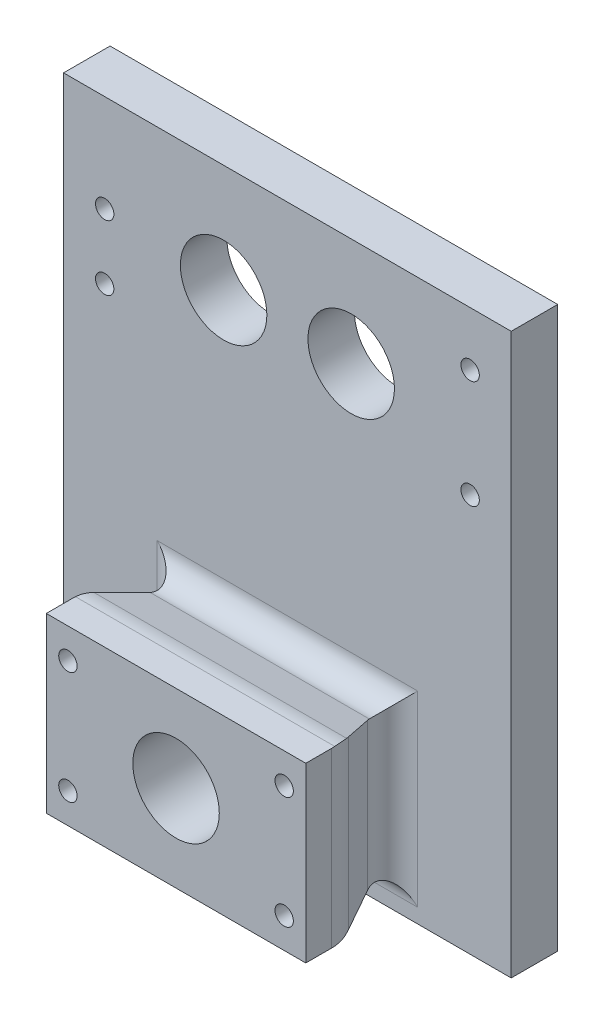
ISO-10303-21;
HEADER;
FILE_DESCRIPTION(('STEP AP214'),'2;1');
FILE_NAME('part.step','',(''),(''),'','','');
FILE_SCHEMA(('AUTOMOTIVE_DESIGN { 1 0 10303 214 1 1 1 1 }'));
ENDSEC;
DATA;
#1=APPLICATION_CONTEXT('core data for automotive mechanical design processes');
#2=APPLICATION_PROTOCOL_DEFINITION('international standard','automotive_design',2000,#1);
#3=PRODUCT_CONTEXT('',#1,'mechanical');
#4=PRODUCT('Part','Part','',(#3));
#5=PRODUCT_RELATED_PRODUCT_CATEGORY('part','',(#4));
#6=PRODUCT_DEFINITION_FORMATION('','',#4);
#7=PRODUCT_DEFINITION_CONTEXT('part definition',#1,'design');
#8=PRODUCT_DEFINITION('design','',#6,#7);
#9=PRODUCT_DEFINITION_SHAPE('','',#8);
#10=(LENGTH_UNIT() NAMED_UNIT(*) SI_UNIT(.MILLI.,.METRE.));
#11=(NAMED_UNIT(*) PLANE_ANGLE_UNIT() SI_UNIT($,.RADIAN.));
#12=(NAMED_UNIT(*) SI_UNIT($,.STERADIAN.) SOLID_ANGLE_UNIT());
#13=UNCERTAINTY_MEASURE_WITH_UNIT(LENGTH_MEASURE(1.E-05),#10,'distance_accuracy_value','');
#14=(GEOMETRIC_REPRESENTATION_CONTEXT(3) GLOBAL_UNCERTAINTY_ASSIGNED_CONTEXT((#13)) GLOBAL_UNIT_ASSIGNED_CONTEXT((#10,
#11,#12)) REPRESENTATION_CONTEXT('',''));
#15=CARTESIAN_POINT('',(0.,0.,0.));
#16=DIRECTION('',(0.,0.,1.));
#17=DIRECTION('',(1.,0.,0.));
#18=AXIS2_PLACEMENT_3D('',#15,#16,#17);
#19=CARTESIAN_POINT('',(-60.,40.,17.));
#20=DIRECTION('',(1.,0.,0.));
#21=DIRECTION('',(0.,1.,0.));
#22=AXIS2_PLACEMENT_3D('',#19,#20,#21);
#23=PLANE('',#22);
#24=DIRECTION('',(0.,0.,-1.));
#25=VECTOR('',#24,1.);
#26=CARTESIAN_POINT('',(-60.,40.,17.));
#27=LINE('',#26,#25);
#28=CARTESIAN_POINT('',(-60.,40.,17.));
#29=VERTEX_POINT('',#28);
#30=CARTESIAN_POINT('',(-60.,40.,5.19968101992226));
#31=VERTEX_POINT('',#30);
#32=EDGE_CURVE('E412',#29,#31,#27,.T.);
#33=ORIENTED_EDGE('',*,*,#32,.T.);
#34=DIRECTION('',(0.,-1.,0.));
#35=VECTOR('',#34,1.);
#36=CARTESIAN_POINT('',(-60.,-40.,5.19968101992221));
#37=LINE('',#36,#35);
#38=CARTESIAN_POINT('',(-60.,-40.,5.19968101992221));
#39=VERTEX_POINT('',#38);
#40=EDGE_CURVE('E399',#31,#39,#37,.T.);
#41=ORIENTED_EDGE('',*,*,#40,.T.);
#42=DIRECTION('',(0.,0.,-1.));
#43=VECTOR('',#42,1.);
#44=CARTESIAN_POINT('',(-60.,-40.,17.));
#45=LINE('',#44,#43);
#46=CARTESIAN_POINT('',(-60.,-40.,17.));
#47=VERTEX_POINT('',#46);
#48=EDGE_CURVE('E416',#47,#39,#45,.T.);
#49=ORIENTED_EDGE('',*,*,#48,.F.);
#50=DIRECTION('',(0.,-1.,0.));
#51=VECTOR('',#50,1.);
#52=CARTESIAN_POINT('',(-60.,40.,17.));
#53=LINE('',#52,#51);
#54=EDGE_CURVE('E277',#29,#47,#53,.T.);
#55=ORIENTED_EDGE('',*,*,#54,.F.);
#56=EDGE_LOOP('',(#33,#41,#49,#55));
#57=FACE_BOUND('',#56,.T.);
#58=ADVANCED_FACE('F46',(#57),#23,.F.);
#59=CARTESIAN_POINT('',(-60.,-40.,17.));
#60=DIRECTION('',(0.,1.,0.));
#61=DIRECTION('',(0.,0.,1.));
#62=AXIS2_PLACEMENT_3D('',#59,#60,#61);
#63=PLANE('',#62);
#64=ORIENTED_EDGE('',*,*,#48,.T.);
#65=CARTESIAN_POINT('',(-35.,-40.,5.19968101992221));
#66=DIRECTION('',(0.,1.,0.));
#67=DIRECTION('',(0.,0.,1.));
#68=AXIS2_PLACEMENT_3D('',#65,#66,#67);
#69=CIRCLE('',#68,25.);
#70=CARTESIAN_POINT('',(-59.9455199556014,-40.,3.55012527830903));
#71=VERTEX_POINT('',#70);
#72=EDGE_CURVE('E429',#39,#71,#69,.F.);
#73=ORIENTED_EDGE('',*,*,#72,.T.);
#74=DIRECTION('',(1.,0.,0.));
#75=VECTOR('',#74,1.);
#76=CARTESIAN_POINT('',(60.,-40.,3.55012527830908));
#77=LINE('',#76,#75);
#78=CARTESIAN_POINT('',(59.9455199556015,-40.,3.55012527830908));
#79=VERTEX_POINT('',#78);
#80=EDGE_CURVE('E426',#71,#79,#77,.T.);
#81=ORIENTED_EDGE('',*,*,#80,.T.);
#82=CARTESIAN_POINT('',(35.,-40.,5.19968101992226));
#83=DIRECTION('',(0.,1.,0.));
#84=DIRECTION('',(0.,0.,1.));
#85=AXIS2_PLACEMENT_3D('',#82,#83,#84);
#86=CIRCLE('',#85,25.);
#87=CARTESIAN_POINT('',(60.,-40.,5.19968101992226));
#88=VERTEX_POINT('',#87);
#89=EDGE_CURVE('E420',#79,#88,#86,.F.);
#90=ORIENTED_EDGE('',*,*,#89,.T.);
#91=DIRECTION('',(0.,0.,-1.));
#92=VECTOR('',#91,1.);
#93=CARTESIAN_POINT('',(60.,-40.,17.));
#94=LINE('',#93,#92);
#95=CARTESIAN_POINT('',(60.,-40.,17.));
#96=VERTEX_POINT('',#95);
#97=EDGE_CURVE('E413',#96,#88,#94,.T.);
#98=ORIENTED_EDGE('',*,*,#97,.F.);
#99=DIRECTION('',(1.,0.,0.));
#100=VECTOR('',#99,1.);
#101=CARTESIAN_POINT('',(-60.,-40.,17.));
#102=LINE('',#101,#100);
#103=EDGE_CURVE('E406',#47,#96,#102,.T.);
#104=ORIENTED_EDGE('',*,*,#103,.F.);
#105=EDGE_LOOP('',(#64,#73,#81,#90,#98,#104));
#106=FACE_BOUND('',#105,.T.);
#107=ADVANCED_FACE('F447',(#106),#63,.F.);
#108=CARTESIAN_POINT('',(60.,40.,17.));
#109=DIRECTION('',(-1.,0.,0.));
#110=DIRECTION('',(0.,-1.,0.));
#111=AXIS2_PLACEMENT_3D('',#108,#109,#110);
#112=PLANE('',#111);
#113=ORIENTED_EDGE('',*,*,#97,.T.);
#114=DIRECTION('',(0.,1.,0.));
#115=VECTOR('',#114,1.);
#116=CARTESIAN_POINT('',(60.,40.,5.19968101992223));
#117=LINE('',#116,#115);
#118=CARTESIAN_POINT('',(60.,40.,5.19968101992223));
#119=VERTEX_POINT('',#118);
#120=EDGE_CURVE('E293',#88,#119,#117,.T.);
#121=ORIENTED_EDGE('',*,*,#120,.T.);
#122=DIRECTION('',(0.,0.,-1.));
#123=VECTOR('',#122,1.);
#124=CARTESIAN_POINT('',(60.,40.,17.));
#125=LINE('',#124,#123);
#126=CARTESIAN_POINT('',(60.,40.,17.));
#127=VERTEX_POINT('',#126);
#128=EDGE_CURVE('E417',#127,#119,#125,.T.);
#129=ORIENTED_EDGE('',*,*,#128,.F.);
#130=DIRECTION('',(0.,1.,0.));
#131=VECTOR('',#130,1.);
#132=CARTESIAN_POINT('',(60.,40.,17.));
#133=LINE('',#132,#131);
#134=EDGE_CURVE('E408',#96,#127,#133,.T.);
#135=ORIENTED_EDGE('',*,*,#134,.F.);
#136=EDGE_LOOP('',(#113,#121,#129,#135));
#137=FACE_BOUND('',#136,.T.);
#138=ADVANCED_FACE('F458',(#137),#112,.F.);
#139=CARTESIAN_POINT('',(-60.,40.,17.));
#140=DIRECTION('',(0.,-1.,0.));
#141=DIRECTION('',(0.,0.,-1.));
#142=AXIS2_PLACEMENT_3D('',#139,#140,#141);
#143=PLANE('',#142);
#144=DIRECTION('',(-1.,0.,0.));
#145=VECTOR('',#144,1.);
#146=CARTESIAN_POINT('',(-60.,40.,3.55012527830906));
#147=LINE('',#146,#145);
#148=CARTESIAN_POINT('',(59.9455199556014,40.,3.55012527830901));
#149=VERTEX_POINT('',#148);
#150=CARTESIAN_POINT('',(-59.9455199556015,40.,3.55012527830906));
#151=VERTEX_POINT('',#150);
#152=EDGE_CURVE('E289',#149,#151,#147,.T.);
#153=ORIENTED_EDGE('',*,*,#152,.T.);
#154=CARTESIAN_POINT('',(-35.,40.,5.19968101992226));
#155=DIRECTION('',(0.,-1.,0.));
#156=DIRECTION('',(0.,0.,-1.));
#157=AXIS2_PLACEMENT_3D('',#154,#155,#156);
#158=CIRCLE('',#157,25.);
#159=EDGE_CURVE('E291',#151,#31,#158,.F.);
#160=ORIENTED_EDGE('',*,*,#159,.T.);
#161=ORIENTED_EDGE('',*,*,#32,.F.);
#162=DIRECTION('',(-1.,0.,0.));
#163=VECTOR('',#162,1.);
#164=CARTESIAN_POINT('',(-60.,40.,17.));
#165=LINE('',#164,#163);
#166=EDGE_CURVE('E410',#127,#29,#165,.T.);
#167=ORIENTED_EDGE('',*,*,#166,.F.);
#168=ORIENTED_EDGE('',*,*,#128,.T.);
#169=CARTESIAN_POINT('',(35.,40.,5.19968101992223));
#170=DIRECTION('',(0.,-1.,0.));
#171=DIRECTION('',(0.,0.,-1.));
#172=AXIS2_PLACEMENT_3D('',#169,#170,#171);
#173=CIRCLE('',#172,25.);
#174=EDGE_CURVE('E287',#119,#149,#173,.F.);
#175=ORIENTED_EDGE('',*,*,#174,.T.);
#176=EDGE_LOOP('',(#153,#160,#161,#167,#168,#175));
#177=FACE_BOUND('',#176,.T.);
#178=ADVANCED_FACE('F466',(#177),#143,.F.);
#179=CARTESIAN_POINT('',(0.,0.,17.));
#180=DIRECTION('',(0.,0.,1.));
#181=DIRECTION('',(1.,0.,0.));
#182=AXIS2_PLACEMENT_3D('',#179,#180,#181);
#183=PLANE('',#182);
#184=CARTESIAN_POINT('',(-50.,26.,17.));
#185=DIRECTION('',(0.,0.,1.));
#186=DIRECTION('',(1.,0.,0.));
#187=AXIS2_PLACEMENT_3D('',#184,#185,#186);
#188=CIRCLE('',#187,4.24999999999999);
#189=CARTESIAN_POINT('',(-45.75,26.,17.));
#190=VERTEX_POINT('',#189);
#191=EDGE_CURVE('E203',#190,#190,#188,.T.);
#192=ORIENTED_EDGE('',*,*,#191,.F.);
#193=EDGE_LOOP('',(#192));
#194=FACE_BOUND('',#193,.T.);
#195=CARTESIAN_POINT('',(50.,26.,17.));
#196=DIRECTION('',(0.,0.,1.));
#197=DIRECTION('',(1.,0.,0.));
#198=AXIS2_PLACEMENT_3D('',#195,#196,#197);
#199=CIRCLE('',#198,4.24999999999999);
#200=CARTESIAN_POINT('',(54.25,26.,17.));
#201=VERTEX_POINT('',#200);
#202=EDGE_CURVE('E202',#201,#201,#199,.T.);
#203=ORIENTED_EDGE('',*,*,#202,.F.);
#204=EDGE_LOOP('',(#203));
#205=FACE_BOUND('',#204,.T.);
#206=CARTESIAN_POINT('',(50.,-26.,17.));
#207=DIRECTION('',(0.,0.,1.));
#208=DIRECTION('',(1.,0.,0.));
#209=AXIS2_PLACEMENT_3D('',#206,#207,#208);
#210=CIRCLE('',#209,4.24999999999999);
#211=CARTESIAN_POINT('',(54.25,-26.,17.));
#212=VERTEX_POINT('',#211);
#213=EDGE_CURVE('E215',#212,#212,#210,.T.);
#214=ORIENTED_EDGE('',*,*,#213,.F.);
#215=EDGE_LOOP('',(#214));
#216=FACE_BOUND('',#215,.T.);
#217=CARTESIAN_POINT('',(-50.,-26.,17.));
#218=DIRECTION('',(0.,0.,1.));
#219=DIRECTION('',(1.,0.,0.));
#220=AXIS2_PLACEMENT_3D('',#217,#218,#219);
#221=CIRCLE('',#220,4.24999999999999);
#222=CARTESIAN_POINT('',(-45.75,-26.,17.));
#223=VERTEX_POINT('',#222);
#224=EDGE_CURVE('E221',#223,#223,#221,.T.);
#225=ORIENTED_EDGE('',*,*,#224,.F.);
#226=EDGE_LOOP('',(#225));
#227=FACE_BOUND('',#226,.T.);
#228=CARTESIAN_POINT('',(0.,0.,17.));
#229=DIRECTION('',(0.,0.,1.));
#230=DIRECTION('',(1.,0.,0.));
#231=AXIS2_PLACEMENT_3D('',#228,#229,#230);
#232=CIRCLE('',#231,20.);
#233=CARTESIAN_POINT('',(20.,0.,17.));
#234=VERTEX_POINT('',#233);
#235=EDGE_CURVE('E232',#234,#234,#232,.T.);
#236=ORIENTED_EDGE('',*,*,#235,.F.);
#237=EDGE_LOOP('',(#236));
#238=FACE_BOUND('',#237,.T.);
#239=ORIENTED_EDGE('',*,*,#54,.T.);
#240=ORIENTED_EDGE('',*,*,#103,.T.);
#241=ORIENTED_EDGE('',*,*,#134,.T.);
#242=ORIENTED_EDGE('',*,*,#166,.T.);
#243=EDGE_LOOP('',(#239,#240,#241,#242));
#244=FACE_BOUND('',#243,.T.);
#245=ADVANCED_FACE('F472',(#194,#205,#216,#227,#238,#244),#183,.T.);
#246=CARTESIAN_POINT('',(50.4610492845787,0.,-21.939586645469));
#247=DIRECTION('',(0.917070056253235,0.,-0.39872611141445));
#248=DIRECTION('',(-0.39872611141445,0.,-0.917070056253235));
#249=AXIS2_PLACEMENT_3D('',#246,#247,#248);
#250=PLANE('',#249);
#251=DIRECTION('',(-0.385344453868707,0.256896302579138,-0.886292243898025));
#252=VECTOR('',#251,1.);
#253=CARTESIAN_POINT('',(60.,-40.,0.));
#254=LINE('',#253,#252);
#255=CARTESIAN_POINT('',(57.9267514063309,-38.6178342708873,-4.76847176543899));
#256=VERTEX_POINT('',#255);
#257=CARTESIAN_POINT('',(51.081417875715,-34.05427858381,-20.5127388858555));
#258=VERTEX_POINT('',#257);
#259=EDGE_CURVE('E278',#256,#258,#254,.T.);
#260=ORIENTED_EDGE('',*,*,#259,.T.);
#261=DIRECTION('',(0.,1.,0.));
#262=VECTOR('',#261,1.);
#263=CARTESIAN_POINT('',(51.081417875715,30.,-20.5127388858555));
#264=LINE('',#263,#262);
#265=CARTESIAN_POINT('',(51.081417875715,34.05427858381,-20.5127388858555));
#266=VERTEX_POINT('',#265);
#267=EDGE_CURVE('E351',#258,#266,#264,.T.);
#268=ORIENTED_EDGE('',*,*,#267,.T.);
#269=DIRECTION('',(-0.385344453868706,-0.256896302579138,-0.886292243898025));
#270=VECTOR('',#269,1.);
#271=CARTESIAN_POINT('',(60.,40.,0.));
#272=LINE('',#271,#270);
#273=CARTESIAN_POINT('',(57.9267514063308,38.6178342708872,-4.76847176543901));
#274=VERTEX_POINT('',#273);
#275=EDGE_CURVE('E273',#274,#266,#272,.T.);
#276=ORIENTED_EDGE('',*,*,#275,.F.);
#277=DIRECTION('',(0.,1.,0.));
#278=VECTOR('',#277,1.);
#279=CARTESIAN_POINT('',(57.9267514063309,-40.,-4.76847176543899));
#280=LINE('',#279,#278);
#281=EDGE_CURVE('E295',#274,#256,#280,.F.);
#282=ORIENTED_EDGE('',*,*,#281,.T.);
#283=EDGE_LOOP('',(#260,#268,#276,#282));
#284=FACE_BOUND('',#283,.T.);
#285=ADVANCED_FACE('F474',(#284),#250,.T.);
#286=CARTESIAN_POINT('',(0.,36.8998256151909,-10.6956016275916));
#287=DIRECTION('',(0.,0.960466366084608,-0.278396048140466));
#288=DIRECTION('',(0.,0.278396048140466,0.960466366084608));
#289=AXIS2_PLACEMENT_3D('',#286,#287,#288);
#290=PLANE('',#289);
#291=ORIENTED_EDGE('',*,*,#275,.T.);
#292=CARTESIAN_POINT('',(60.2521184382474,32.8985507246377,-24.5));
#293=DIRECTION('',(0.,0.960466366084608,-0.278396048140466));
#294=DIRECTION('',(0.,-0.278396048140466,-0.960466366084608));
#295=AXIS2_PLACEMENT_3D('',#292,#293,#294);
#296=ELLIPSE('',#295,10.4116087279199,10.);
#297=CARTESIAN_POINT('',(50.6474547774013,33.7054957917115,-21.7160395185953));
#298=VERTEX_POINT('',#297);
#299=EDGE_CURVE('E55',#266,#298,#296,.F.);
#300=ORIENTED_EDGE('',*,*,#299,.T.);
#301=DIRECTION('',(-1.,0.,0.));
#302=VECTOR('',#301,1.);
#303=CARTESIAN_POINT('',(-45.,33.7054957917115,-21.7160395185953));
#304=LINE('',#303,#302);
#305=CARTESIAN_POINT('',(-50.6474547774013,33.7054957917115,-21.7160395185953));
#306=VERTEX_POINT('',#305);
#307=EDGE_CURVE('E297',#298,#306,#304,.T.);
#308=ORIENTED_EDGE('',*,*,#307,.T.);
#309=CARTESIAN_POINT('',(-60.2521184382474,32.8985507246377,-24.5));
#310=DIRECTION('',(0.,0.960466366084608,-0.278396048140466));
#311=DIRECTION('',(0.,0.278396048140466,0.960466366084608));
#312=AXIS2_PLACEMENT_3D('',#309,#310,#311);
#313=ELLIPSE('',#312,10.4116087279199,10.);
#314=CARTESIAN_POINT('',(-51.081417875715,34.05427858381,-20.5127388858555));
#315=VERTEX_POINT('',#314);
#316=EDGE_CURVE('E355',#306,#315,#313,.F.);
#317=ORIENTED_EDGE('',*,*,#316,.T.);
#318=DIRECTION('',(0.385344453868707,-0.256896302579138,-0.886292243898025));
#319=VECTOR('',#318,1.);
#320=CARTESIAN_POINT('',(-60.,40.,0.));
#321=LINE('',#320,#319);
#322=CARTESIAN_POINT('',(-57.9267514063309,38.6178342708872,-4.76847176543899));
#323=VERTEX_POINT('',#322);
#324=EDGE_CURVE('E262',#323,#315,#321,.T.);
#325=ORIENTED_EDGE('',*,*,#324,.F.);
#326=CARTESIAN_POINT('',(-35.,41.507153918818,5.19968101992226));
#327=DIRECTION('',(0.,0.960466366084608,-0.278396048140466));
#328=DIRECTION('',(0.,0.278396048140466,0.960466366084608));
#329=AXIS2_PLACEMENT_3D('',#326,#327,#328);
#330=ELLIPSE('',#329,26.0290218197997,25.);
#331=CARTESIAN_POINT('',(-58.4707744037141,39.0116591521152,-3.40977592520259));
#332=VERTEX_POINT('',#331);
#333=EDGE_CURVE('E285',#323,#332,#330,.T.);
#334=ORIENTED_EDGE('',*,*,#333,.T.);
#335=DIRECTION('',(-1.,0.,0.));
#336=VECTOR('',#335,1.);
#337=CARTESIAN_POINT('',(60.,39.0116591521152,-3.40977592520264));
#338=LINE('',#337,#336);
#339=CARTESIAN_POINT('',(58.4707744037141,39.0116591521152,-3.40977592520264));
#340=VERTEX_POINT('',#339);
#341=EDGE_CURVE('E283',#332,#340,#338,.F.);
#342=ORIENTED_EDGE('',*,*,#341,.T.);
#343=CARTESIAN_POINT('',(35.,41.507153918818,5.19968101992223));
#344=DIRECTION('',(0.,0.960466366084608,-0.278396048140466));
#345=DIRECTION('',(0.,-0.278396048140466,-0.960466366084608));
#346=AXIS2_PLACEMENT_3D('',#343,#344,#345);
#347=ELLIPSE('',#346,26.0290218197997,25.);
#348=EDGE_CURVE('E281',#340,#274,#347,.T.);
#349=ORIENTED_EDGE('',*,*,#348,.T.);
#350=EDGE_LOOP('',(#291,#300,#308,#317,#325,#334,#342,#349));
#351=FACE_BOUND('',#350,.T.);
#352=ADVANCED_FACE('F388',(#351),#290,.T.);
#353=CARTESIAN_POINT('',(0.,-36.8998256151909,-10.6956016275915));
#354=DIRECTION('',(0.,-0.960466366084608,-0.278396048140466));
#355=DIRECTION('',(0.,0.278396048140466,-0.960466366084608));
#356=AXIS2_PLACEMENT_3D('',#353,#354,#355);
#357=PLANE('',#356);
#358=CARTESIAN_POINT('',(-60.2521184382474,-32.8985507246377,-24.5));
#359=DIRECTION('',(0.,-0.960466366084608,-0.278396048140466));
#360=DIRECTION('',(0.,0.278396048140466,-0.960466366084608));
#361=AXIS2_PLACEMENT_3D('',#358,#359,#360);
#362=ELLIPSE('',#361,10.4116087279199,10.);
#363=CARTESIAN_POINT('',(-51.081417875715,-34.05427858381,-20.5127388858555));
#364=VERTEX_POINT('',#363);
#365=CARTESIAN_POINT('',(-50.6474547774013,-33.7054957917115,-21.7160395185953));
#366=VERTEX_POINT('',#365);
#367=EDGE_CURVE('E353',#364,#366,#362,.F.);
#368=ORIENTED_EDGE('',*,*,#367,.T.);
#369=DIRECTION('',(1.,0.,0.));
#370=VECTOR('',#369,1.);
#371=CARTESIAN_POINT('',(45.,-33.7054957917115,-21.7160395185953));
#372=LINE('',#371,#370);
#373=CARTESIAN_POINT('',(50.6474547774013,-33.7054957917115,-21.7160395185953));
#374=VERTEX_POINT('',#373);
#375=EDGE_CURVE('E62',#366,#374,#372,.T.);
#376=ORIENTED_EDGE('',*,*,#375,.T.);
#377=CARTESIAN_POINT('',(60.2521184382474,-32.8985507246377,-24.5));
#378=DIRECTION('',(0.,-0.960466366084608,-0.278396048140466));
#379=DIRECTION('',(0.,-0.278396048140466,0.960466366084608));
#380=AXIS2_PLACEMENT_3D('',#377,#378,#379);
#381=ELLIPSE('',#380,10.4116087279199,10.);
#382=EDGE_CURVE('E12',#374,#258,#381,.F.);
#383=ORIENTED_EDGE('',*,*,#382,.T.);
#384=ORIENTED_EDGE('',*,*,#259,.F.);
#385=CARTESIAN_POINT('',(35.,-41.507153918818,5.19968101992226));
#386=DIRECTION('',(0.,-0.960466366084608,-0.278396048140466));
#387=DIRECTION('',(0.,-0.278396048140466,0.960466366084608));
#388=AXIS2_PLACEMENT_3D('',#385,#386,#387);
#389=ELLIPSE('',#388,26.0290218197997,25.);
#390=CARTESIAN_POINT('',(58.4707744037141,-39.0116591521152,-3.40977592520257));
#391=VERTEX_POINT('',#390);
#392=EDGE_CURVE('E430',#256,#391,#389,.T.);
#393=ORIENTED_EDGE('',*,*,#392,.T.);
#394=DIRECTION('',(1.,0.,0.));
#395=VECTOR('',#394,1.);
#396=CARTESIAN_POINT('',(-60.,-39.0116591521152,-3.40977592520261));
#397=LINE('',#396,#395);
#398=CARTESIAN_POINT('',(-58.4707744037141,-39.0116591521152,-3.40977592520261));
#399=VERTEX_POINT('',#398);
#400=EDGE_CURVE('E435',#391,#399,#397,.F.);
#401=ORIENTED_EDGE('',*,*,#400,.T.);
#402=CARTESIAN_POINT('',(-35.,-41.507153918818,5.19968101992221));
#403=DIRECTION('',(0.,-0.960466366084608,-0.278396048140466));
#404=DIRECTION('',(0.,0.278396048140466,-0.960466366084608));
#405=AXIS2_PLACEMENT_3D('',#402,#403,#404);
#406=ELLIPSE('',#405,26.0290218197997,25.);
#407=CARTESIAN_POINT('',(-57.9267514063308,-38.6178342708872,-4.76847176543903));
#408=VERTEX_POINT('',#407);
#409=EDGE_CURVE('E437',#399,#408,#406,.T.);
#410=ORIENTED_EDGE('',*,*,#409,.T.);
#411=DIRECTION('',(0.385344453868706,0.256896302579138,-0.886292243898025));
#412=VECTOR('',#411,1.);
#413=CARTESIAN_POINT('',(-60.,-40.,0.));
#414=LINE('',#413,#412);
#415=EDGE_CURVE('E395',#408,#364,#414,.T.);
#416=ORIENTED_EDGE('',*,*,#415,.T.);
#417=EDGE_LOOP('',(#368,#376,#383,#384,#393,#401,#410,#416));
#418=FACE_BOUND('',#417,.T.);
#419=ADVANCED_FACE('F520',(#418),#357,.T.);
#420=CARTESIAN_POINT('',(-50.4610492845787,0.,-21.939586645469));
#421=DIRECTION('',(-0.917070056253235,0.,-0.39872611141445));
#422=DIRECTION('',(-0.39872611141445,0.,0.917070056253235));
#423=AXIS2_PLACEMENT_3D('',#420,#421,#422);
#424=PLANE('',#423);
#425=ORIENTED_EDGE('',*,*,#324,.T.);
#426=DIRECTION('',(0.,-1.,0.));
#427=VECTOR('',#426,1.);
#428=CARTESIAN_POINT('',(-51.081417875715,-30.,-20.5127388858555));
#429=LINE('',#428,#427);
#430=EDGE_CURVE('E348',#315,#364,#429,.T.);
#431=ORIENTED_EDGE('',*,*,#430,.T.);
#432=ORIENTED_EDGE('',*,*,#415,.F.);
#433=DIRECTION('',(0.,-1.,0.));
#434=VECTOR('',#433,1.);
#435=CARTESIAN_POINT('',(-57.9267514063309,40.,-4.76847176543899));
#436=LINE('',#435,#434);
#437=EDGE_CURVE('E279',#408,#323,#436,.F.);
#438=ORIENTED_EDGE('',*,*,#437,.T.);
#439=EDGE_LOOP('',(#425,#431,#432,#438));
#440=FACE_BOUND('',#439,.T.);
#441=ADVANCED_FACE('F391',(#440),#424,.T.);
#442=CARTESIAN_POINT('',(103.5,-50.,-56.));
#443=DIRECTION('',(1.,0.,0.));
#444=DIRECTION('',(0.,0.,-1.));
#445=AXIS2_PLACEMENT_3D('',#442,#443,#444);
#446=PLANE('',#445);
#447=DIRECTION('',(0.,1.,0.));
#448=VECTOR('',#447,1.);
#449=CARTESIAN_POINT('',(103.5,-50.,-34.5));
#450=LINE('',#449,#448);
#451=CARTESIAN_POINT('',(103.5,-50.,-34.5));
#452=VERTEX_POINT('',#451);
#453=CARTESIAN_POINT('',(103.5,209.,-34.5));
#454=VERTEX_POINT('',#453);
#455=EDGE_CURVE('E231',#452,#454,#450,.T.);
#456=ORIENTED_EDGE('',*,*,#455,.F.);
#457=DIRECTION('',(0.,0.,1.));
#458=VECTOR('',#457,1.);
#459=CARTESIAN_POINT('',(103.5,-50.,-56.));
#460=LINE('',#459,#458);
#461=CARTESIAN_POINT('',(103.5,-50.,-56.));
#462=VERTEX_POINT('',#461);
#463=EDGE_CURVE('E260',#462,#452,#460,.T.);
#464=ORIENTED_EDGE('',*,*,#463,.F.);
#465=DIRECTION('',(0.,1.,0.));
#466=VECTOR('',#465,1.);
#467=CARTESIAN_POINT('',(103.5,-50.,-56.));
#468=LINE('',#467,#466);
#469=CARTESIAN_POINT('',(103.5,209.,-56.));
#470=VERTEX_POINT('',#469);
#471=EDGE_CURVE('E236',#462,#470,#468,.T.);
#472=ORIENTED_EDGE('',*,*,#471,.T.);
#473=DIRECTION('',(0.,0.,1.));
#474=VECTOR('',#473,1.);
#475=CARTESIAN_POINT('',(103.5,209.,-56.));
#476=LINE('',#475,#474);
#477=EDGE_CURVE('E249',#470,#454,#476,.T.);
#478=ORIENTED_EDGE('',*,*,#477,.T.);
#479=EDGE_LOOP('',(#456,#464,#472,#478));
#480=FACE_BOUND('',#479,.T.);
#481=ADVANCED_FACE('F533',(#480),#446,.T.);
#482=CARTESIAN_POINT('',(103.5,-50.,-56.));
#483=DIRECTION('',(0.,-1.,0.));
#484=DIRECTION('',(1.,0.,0.));
#485=AXIS2_PLACEMENT_3D('',#482,#483,#484);
#486=PLANE('',#485);
#487=DIRECTION('',(1.,0.,0.));
#488=VECTOR('',#487,1.);
#489=CARTESIAN_POINT('',(103.5,-50.,-34.5));
#490=LINE('',#489,#488);
#491=CARTESIAN_POINT('',(-103.5,-50.,-34.5));
#492=VERTEX_POINT('',#491);
#493=EDGE_CURVE('E240',#492,#452,#490,.T.);
#494=ORIENTED_EDGE('',*,*,#493,.F.);
#495=DIRECTION('',(0.,0.,1.));
#496=VECTOR('',#495,1.);
#497=CARTESIAN_POINT('',(-103.5,-50.,-56.));
#498=LINE('',#497,#496);
#499=CARTESIAN_POINT('',(-103.5,-50.,-56.));
#500=VERTEX_POINT('',#499);
#501=EDGE_CURVE('E263',#500,#492,#498,.T.);
#502=ORIENTED_EDGE('',*,*,#501,.F.);
#503=DIRECTION('',(1.,0.,0.));
#504=VECTOR('',#503,1.);
#505=CARTESIAN_POINT('',(103.5,-50.,-56.));
#506=LINE('',#505,#504);
#507=EDGE_CURVE('E246',#500,#462,#506,.T.);
#508=ORIENTED_EDGE('',*,*,#507,.T.);
#509=ORIENTED_EDGE('',*,*,#463,.T.);
#510=EDGE_LOOP('',(#494,#502,#508,#509));
#511=FACE_BOUND('',#510,.T.);
#512=ADVANCED_FACE('F540',(#511),#486,.T.);
#513=CARTESIAN_POINT('',(-103.5,-50.,-56.));
#514=DIRECTION('',(-1.,0.,0.));
#515=DIRECTION('',(0.,-1.,0.));
#516=AXIS2_PLACEMENT_3D('',#513,#514,#515);
#517=PLANE('',#516);
#518=DIRECTION('',(0.,-1.,0.));
#519=VECTOR('',#518,1.);
#520=CARTESIAN_POINT('',(-103.5,-50.,-34.5));
#521=LINE('',#520,#519);
#522=CARTESIAN_POINT('',(-103.5,209.,-34.5));
#523=VERTEX_POINT('',#522);
#524=EDGE_CURVE('E255',#523,#492,#521,.T.);
#525=ORIENTED_EDGE('',*,*,#524,.F.);
#526=DIRECTION('',(0.,0.,1.));
#527=VECTOR('',#526,1.);
#528=CARTESIAN_POINT('',(-103.5,209.,-56.));
#529=LINE('',#528,#527);
#530=CARTESIAN_POINT('',(-103.5,209.,-56.));
#531=VERTEX_POINT('',#530);
#532=EDGE_CURVE('E265',#531,#523,#529,.T.);
#533=ORIENTED_EDGE('',*,*,#532,.F.);
#534=DIRECTION('',(0.,-1.,0.));
#535=VECTOR('',#534,1.);
#536=CARTESIAN_POINT('',(-103.5,-50.,-56.));
#537=LINE('',#536,#535);
#538=EDGE_CURVE('E243',#531,#500,#537,.T.);
#539=ORIENTED_EDGE('',*,*,#538,.T.);
#540=ORIENTED_EDGE('',*,*,#501,.T.);
#541=EDGE_LOOP('',(#525,#533,#539,#540));
#542=FACE_BOUND('',#541,.T.);
#543=ADVANCED_FACE('F548',(#542),#517,.T.);
#544=CARTESIAN_POINT('',(103.5,209.,-56.));
#545=DIRECTION('',(0.,1.,0.));
#546=DIRECTION('',(0.,0.,1.));
#547=AXIS2_PLACEMENT_3D('',#544,#545,#546);
#548=PLANE('',#547);
#549=DIRECTION('',(-1.,0.,0.));
#550=VECTOR('',#549,1.);
#551=CARTESIAN_POINT('',(103.5,209.,-34.5));
#552=LINE('',#551,#550);
#553=EDGE_CURVE('E252',#454,#523,#552,.T.);
#554=ORIENTED_EDGE('',*,*,#553,.F.);
#555=ORIENTED_EDGE('',*,*,#477,.F.);
#556=DIRECTION('',(-1.,0.,0.));
#557=VECTOR('',#556,1.);
#558=CARTESIAN_POINT('',(103.5,209.,-56.));
#559=LINE('',#558,#557);
#560=EDGE_CURVE('E239',#470,#531,#559,.T.);
#561=ORIENTED_EDGE('',*,*,#560,.T.);
#562=ORIENTED_EDGE('',*,*,#532,.T.);
#563=EDGE_LOOP('',(#554,#555,#561,#562));
#564=FACE_BOUND('',#563,.T.);
#565=ADVANCED_FACE('F556',(#564),#548,.T.);
#566=CARTESIAN_POINT('',(0.,0.,-56.));
#567=DIRECTION('',(0.,0.,1.));
#568=DIRECTION('',(1.,0.,0.));
#569=AXIS2_PLACEMENT_3D('',#566,#567,#568);
#570=PLANE('',#569);
#571=CARTESIAN_POINT('',(29.5,159.,-56.));
#572=DIRECTION('',(0.,0.,1.));
#573=DIRECTION('',(1.,0.,0.));
#574=AXIS2_PLACEMENT_3D('',#571,#572,#573);
#575=CIRCLE('',#574,20.);
#576=CARTESIAN_POINT('',(49.5,159.,-56.));
#577=VERTEX_POINT('',#576);
#578=EDGE_CURVE('E806',#577,#577,#575,.T.);
#579=ORIENTED_EDGE('',*,*,#578,.T.);
#580=EDGE_LOOP('',(#579));
#581=FACE_BOUND('',#580,.T.);
#582=CARTESIAN_POINT('',(-29.5,159.,-56.));
#583=DIRECTION('',(0.,0.,1.));
#584=DIRECTION('',(1.,0.,0.));
#585=AXIS2_PLACEMENT_3D('',#582,#583,#584);
#586=CIRCLE('',#585,20.);
#587=CARTESIAN_POINT('',(-9.50000000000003,159.,-56.));
#588=VERTEX_POINT('',#587);
#589=EDGE_CURVE('E814',#588,#588,#586,.T.);
#590=ORIENTED_EDGE('',*,*,#589,.T.);
#591=EDGE_LOOP('',(#590));
#592=FACE_BOUND('',#591,.T.);
#593=CARTESIAN_POINT('',(84.5000000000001,183.999999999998,-56.));
#594=DIRECTION('',(0.,0.,1.));
#595=DIRECTION('',(1.,0.,0.));
#596=AXIS2_PLACEMENT_3D('',#593,#594,#595);
#597=CIRCLE('',#596,4.24999999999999);
#598=CARTESIAN_POINT('',(88.7500000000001,183.999999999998,-56.));
#599=VERTEX_POINT('',#598);
#600=EDGE_CURVE('E822',#599,#599,#597,.T.);
#601=ORIENTED_EDGE('',*,*,#600,.T.);
#602=EDGE_LOOP('',(#601));
#603=FACE_BOUND('',#602,.T.);
#604=CARTESIAN_POINT('',(84.5000000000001,133.999999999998,-56.));
#605=DIRECTION('',(0.,0.,1.));
#606=DIRECTION('',(1.,0.,0.));
#607=AXIS2_PLACEMENT_3D('',#604,#605,#606);
#608=CIRCLE('',#607,4.24999999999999);
#609=CARTESIAN_POINT('',(88.7500000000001,133.999999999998,-56.));
#610=VERTEX_POINT('',#609);
#611=EDGE_CURVE('E828',#610,#610,#608,.T.);
#612=ORIENTED_EDGE('',*,*,#611,.T.);
#613=EDGE_LOOP('',(#612));
#614=FACE_BOUND('',#613,.T.);
#615=CARTESIAN_POINT('',(-84.4999999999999,163.999999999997,-56.));
#616=DIRECTION('',(0.,0.,1.));
#617=DIRECTION('',(1.,0.,0.));
#618=AXIS2_PLACEMENT_3D('',#615,#616,#617);
#619=CIRCLE('',#618,4.24999999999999);
#620=CARTESIAN_POINT('',(-80.25,163.999999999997,-56.));
#621=VERTEX_POINT('',#620);
#622=EDGE_CURVE('E834',#621,#621,#619,.T.);
#623=ORIENTED_EDGE('',*,*,#622,.T.);
#624=EDGE_LOOP('',(#623));
#625=FACE_BOUND('',#624,.T.);
#626=CARTESIAN_POINT('',(-84.4999999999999,133.999999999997,-56.));
#627=DIRECTION('',(0.,0.,1.));
#628=DIRECTION('',(1.,0.,0.));
#629=AXIS2_PLACEMENT_3D('',#626,#627,#628);
#630=CIRCLE('',#629,4.24999999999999);
#631=CARTESIAN_POINT('',(-80.25,133.999999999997,-56.));
#632=VERTEX_POINT('',#631);
#633=EDGE_CURVE('E209',#632,#632,#630,.T.);
#634=ORIENTED_EDGE('',*,*,#633,.T.);
#635=EDGE_LOOP('',(#634));
#636=FACE_BOUND('',#635,.T.);
#637=CARTESIAN_POINT('',(0.,0.,-56.));
#638=DIRECTION('',(0.,0.,1.));
#639=DIRECTION('',(1.,0.,0.));
#640=AXIS2_PLACEMENT_3D('',#637,#638,#639);
#641=CIRCLE('',#640,20.);
#642=CARTESIAN_POINT('',(20.,0.,-56.));
#643=VERTEX_POINT('',#642);
#644=EDGE_CURVE('E228',#643,#643,#641,.T.);
#645=ORIENTED_EDGE('',*,*,#644,.T.);
#646=EDGE_LOOP('',(#645));
#647=FACE_BOUND('',#646,.T.);
#648=ORIENTED_EDGE('',*,*,#471,.F.);
#649=ORIENTED_EDGE('',*,*,#507,.F.);
#650=ORIENTED_EDGE('',*,*,#538,.F.);
#651=ORIENTED_EDGE('',*,*,#560,.F.);
#652=EDGE_LOOP('',(#648,#649,#650,#651));
#653=FACE_BOUND('',#652,.T.);
#654=ADVANCED_FACE('F564',(#581,#592,#603,#614,#625,#636,#647,#653),#570,.F.);
#655=CARTESIAN_POINT('',(0.,0.,-34.5));
#656=DIRECTION('',(0.,0.,1.));
#657=DIRECTION('',(1.,0.,0.));
#658=AXIS2_PLACEMENT_3D('',#655,#656,#657);
#659=PLANE('',#658);
#660=CARTESIAN_POINT('',(29.5,159.,-34.5));
#661=DIRECTION('',(0.,0.,1.));
#662=DIRECTION('',(1.,0.,0.));
#663=AXIS2_PLACEMENT_3D('',#660,#661,#662);
#664=CIRCLE('',#663,20.);
#665=CARTESIAN_POINT('',(49.5,159.,-34.5));
#666=VERTEX_POINT('',#665);
#667=EDGE_CURVE('E809',#666,#666,#664,.T.);
#668=ORIENTED_EDGE('',*,*,#667,.F.);
#669=EDGE_LOOP('',(#668));
#670=FACE_BOUND('',#669,.T.);
#671=CARTESIAN_POINT('',(-29.5,159.,-34.5));
#672=DIRECTION('',(0.,0.,1.));
#673=DIRECTION('',(1.,0.,0.));
#674=AXIS2_PLACEMENT_3D('',#671,#672,#673);
#675=CIRCLE('',#674,20.);
#676=CARTESIAN_POINT('',(-9.50000000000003,159.,-34.5));
#677=VERTEX_POINT('',#676);
#678=EDGE_CURVE('E811',#677,#677,#675,.T.);
#679=ORIENTED_EDGE('',*,*,#678,.F.);
#680=EDGE_LOOP('',(#679));
#681=FACE_BOUND('',#680,.T.);
#682=CARTESIAN_POINT('',(84.5000000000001,183.999999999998,-34.5));
#683=DIRECTION('',(0.,0.,1.));
#684=DIRECTION('',(1.,0.,0.));
#685=AXIS2_PLACEMENT_3D('',#682,#683,#684);
#686=CIRCLE('',#685,4.24999999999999);
#687=CARTESIAN_POINT('',(88.7500000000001,183.999999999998,-34.5));
#688=VERTEX_POINT('',#687);
#689=EDGE_CURVE('E817',#688,#688,#686,.T.);
#690=ORIENTED_EDGE('',*,*,#689,.F.);
#691=EDGE_LOOP('',(#690));
#692=FACE_BOUND('',#691,.T.);
#693=CARTESIAN_POINT('',(84.5000000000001,133.999999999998,-34.5));
#694=DIRECTION('',(0.,0.,1.));
#695=DIRECTION('',(1.,0.,0.));
#696=AXIS2_PLACEMENT_3D('',#693,#694,#695);
#697=CIRCLE('',#696,4.24999999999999);
#698=CARTESIAN_POINT('',(88.7500000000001,133.999999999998,-34.5));
#699=VERTEX_POINT('',#698);
#700=EDGE_CURVE('E825',#699,#699,#697,.T.);
#701=ORIENTED_EDGE('',*,*,#700,.F.);
#702=EDGE_LOOP('',(#701));
#703=FACE_BOUND('',#702,.T.);
#704=CARTESIAN_POINT('',(-84.4999999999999,163.999999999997,-34.5));
#705=DIRECTION('',(0.,0.,1.));
#706=DIRECTION('',(1.,0.,0.));
#707=AXIS2_PLACEMENT_3D('',#704,#705,#706);
#708=CIRCLE('',#707,4.24999999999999);
#709=CARTESIAN_POINT('',(-80.25,163.999999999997,-34.5));
#710=VERTEX_POINT('',#709);
#711=EDGE_CURVE('E831',#710,#710,#708,.T.);
#712=ORIENTED_EDGE('',*,*,#711,.F.);
#713=EDGE_LOOP('',(#712));
#714=FACE_BOUND('',#713,.T.);
#715=CARTESIAN_POINT('',(-84.4999999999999,133.999999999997,-34.5));
#716=DIRECTION('',(0.,0.,1.));
#717=DIRECTION('',(1.,0.,0.));
#718=AXIS2_PLACEMENT_3D('',#715,#716,#717);
#719=CIRCLE('',#718,4.24999999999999);
#720=CARTESIAN_POINT('',(-80.25,133.999999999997,-34.5));
#721=VERTEX_POINT('',#720);
#722=EDGE_CURVE('E837',#721,#721,#719,.T.);
#723=ORIENTED_EDGE('',*,*,#722,.F.);
#724=EDGE_LOOP('',(#723));
#725=FACE_BOUND('',#724,.T.);
#726=DIRECTION('',(0.,-1.,0.));
#727=VECTOR('',#726,1.);
#728=CARTESIAN_POINT('',(-60.2521184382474,30.,-34.5));
#729=LINE('',#728,#727);
#730=CARTESIAN_POINT('',(-60.2521184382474,-43.3101594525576,-34.5));
#731=VERTEX_POINT('',#730);
#732=CARTESIAN_POINT('',(-60.2521184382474,43.3101594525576,-34.5));
#733=VERTEX_POINT('',#732);
#734=EDGE_CURVE('E343',#731,#733,#729,.F.);
#735=ORIENTED_EDGE('',*,*,#734,.T.);
#736=DIRECTION('',(-1.,0.,0.));
#737=VECTOR('',#736,1.);
#738=CARTESIAN_POINT('',(45.,43.3101594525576,-34.5));
#739=LINE('',#738,#737);
#740=CARTESIAN_POINT('',(60.2521184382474,43.3101594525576,-34.5));
#741=VERTEX_POINT('',#740);
#742=EDGE_CURVE('E345',#733,#741,#739,.F.);
#743=ORIENTED_EDGE('',*,*,#742,.T.);
#744=DIRECTION('',(0.,1.,0.));
#745=VECTOR('',#744,1.);
#746=CARTESIAN_POINT('',(60.2521184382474,-30.,-34.5));
#747=LINE('',#746,#745);
#748=CARTESIAN_POINT('',(60.2521184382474,-43.3101594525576,-34.5));
#749=VERTEX_POINT('',#748);
#750=EDGE_CURVE('E339',#741,#749,#747,.F.);
#751=ORIENTED_EDGE('',*,*,#750,.T.);
#752=DIRECTION('',(1.,0.,0.));
#753=VECTOR('',#752,1.);
#754=CARTESIAN_POINT('',(-45.,-43.3101594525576,-34.5));
#755=LINE('',#754,#753);
#756=EDGE_CURVE('E341',#749,#731,#755,.F.);
#757=ORIENTED_EDGE('',*,*,#756,.T.);
#758=EDGE_LOOP('',(#735,#743,#751,#757));
#759=FACE_BOUND('',#758,.T.);
#760=ORIENTED_EDGE('',*,*,#455,.T.);
#761=ORIENTED_EDGE('',*,*,#553,.T.);
#762=ORIENTED_EDGE('',*,*,#524,.T.);
#763=ORIENTED_EDGE('',*,*,#493,.T.);
#764=EDGE_LOOP('',(#760,#761,#762,#763));
#765=FACE_BOUND('',#764,.T.);
#766=ADVANCED_FACE('F376',(#670,#681,#692,#703,#714,#725,#759,#765),#659,.T.);
#767=CARTESIAN_POINT('',(0.,0.,-56.));
#768=DIRECTION('',(0.,0.,1.));
#769=DIRECTION('',(1.,0.,0.));
#770=AXIS2_PLACEMENT_3D('',#767,#768,#769);
#771=CYLINDRICAL_SURFACE('',#770,20.);
#772=ORIENTED_EDGE('',*,*,#644,.F.);
#773=EDGE_LOOP('',(#772));
#774=FACE_BOUND('',#773,.T.);
#775=ORIENTED_EDGE('',*,*,#235,.T.);
#776=EDGE_LOOP('',(#775));
#777=FACE_BOUND('',#776,.T.);
#778=ADVANCED_FACE('F584',(#774,#777),#771,.F.);
#779=CARTESIAN_POINT('',(-60.,15.,3.55012527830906));
#780=DIRECTION('',(1.,0.,0.));
#781=DIRECTION('',(0.,0.,-1.));
#782=AXIS2_PLACEMENT_3D('',#779,#780,#781);
#783=CYLINDRICAL_SURFACE('',#782,25.);
#784=CARTESIAN_POINT('',(58.4707744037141,39.0116591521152,-3.40977592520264));
#785=CARTESIAN_POINT('',(58.5713153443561,39.0911055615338,-3.13568099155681));
#786=CARTESIAN_POINT('',(58.6674379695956,39.1662776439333,-2.85878153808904));
#787=CARTESIAN_POINT('',(58.8504987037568,39.3076753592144,-2.29967421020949));
#788=CARTESIAN_POINT('',(58.9374356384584,39.373899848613,-2.01746566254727));
#789=CARTESIAN_POINT('',(59.1823172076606,39.5573337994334,-1.16894931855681));
#790=CARTESIAN_POINT('',(59.3262930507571,39.6608572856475,-0.595425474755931));
#791=CARTESIAN_POINT('',(59.5120289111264,39.7863324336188,0.275373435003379));
#792=CARTESIAN_POINT('',(59.5689127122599,39.8231943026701,0.567461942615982));
#793=CARTESIAN_POINT('',(59.6723747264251,39.8867145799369,1.1545957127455));
#794=CARTESIAN_POINT('',(59.7189529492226,39.9133729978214,1.44964097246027));
#795=CARTESIAN_POINT('',(59.8019652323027,39.9564351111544,2.04474677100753));
#796=CARTESIAN_POINT('',(59.8382994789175,39.9727397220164,2.34482836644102));
#797=CARTESIAN_POINT('',(59.9000984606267,39.9945284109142,2.9465232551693));
#798=CARTESIAN_POINT('',(59.9255623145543,40.0000116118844,3.24813667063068));
#799=CARTESIAN_POINT('',(59.9455199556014,40.,3.55012527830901));
#800=B_SPLINE_CURVE_WITH_KNOTS('',3,(#784,#785,#786,#787,#788,#789,#790,#791,#792,#793,#794,
#795,#796,#797,#798,#799),.UNSPECIFIED.,.F.,.F.,(4,2,2,2,2,2,2,4),(0.,0.907523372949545,
1.81516261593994,3.61285516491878,4.51212502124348,5.41139402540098,6.31914413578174,
7.22696781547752),.UNSPECIFIED.);
#801=EDGE_CURVE('E334',#340,#149,#800,.T.);
#802=ORIENTED_EDGE('',*,*,#801,.F.);
#803=ORIENTED_EDGE('',*,*,#341,.F.);
#804=CARTESIAN_POINT('',(-58.4707744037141,39.0116591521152,-3.40977592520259));
#805=CARTESIAN_POINT('',(-58.5713153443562,39.0911055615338,-3.13568099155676));
#806=CARTESIAN_POINT('',(-58.6674379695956,39.1662776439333,-2.85878153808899));
#807=CARTESIAN_POINT('',(-58.8504987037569,39.3076753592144,-2.29967421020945));
#808=CARTESIAN_POINT('',(-58.9374356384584,39.373899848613,-2.01746566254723));
#809=CARTESIAN_POINT('',(-59.1823172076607,39.5573337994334,-1.16894931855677));
#810=CARTESIAN_POINT('',(-59.3262930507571,39.6608572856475,-0.595425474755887));
#811=CARTESIAN_POINT('',(-59.5120289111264,39.7863324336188,0.275373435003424));
#812=CARTESIAN_POINT('',(-59.5689127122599,39.8231943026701,0.567461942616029));
#813=CARTESIAN_POINT('',(-59.6723747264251,39.8867145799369,1.15459571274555));
#814=CARTESIAN_POINT('',(-59.7189529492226,39.9133729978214,1.44964097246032));
#815=CARTESIAN_POINT('',(-59.8019652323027,39.9564351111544,2.04474677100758));
#816=CARTESIAN_POINT('',(-59.8382994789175,39.9727397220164,2.34482836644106));
#817=CARTESIAN_POINT('',(-59.9000984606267,39.9945284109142,2.94652325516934));
#818=CARTESIAN_POINT('',(-59.9255623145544,40.0000116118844,3.24813667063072));
#819=CARTESIAN_POINT('',(-59.9455199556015,40.,3.55012527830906));
#820=B_SPLINE_CURVE_WITH_KNOTS('',3,(#804,#805,#806,#807,#808,#809,#810,#811,#812,#813,#814,
#815,#816,#817,#818,#819),.UNSPECIFIED.,.F.,.F.,(4,2,2,2,2,2,2,4),(0.,0.907523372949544,
1.81516261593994,3.61285516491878,4.51212502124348,5.41139402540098,6.31914413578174,
7.22696781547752),.UNSPECIFIED.);
#821=EDGE_CURVE('E235',#151,#332,#820,.F.);
#822=ORIENTED_EDGE('',*,*,#821,.F.);
#823=ORIENTED_EDGE('',*,*,#152,.F.);
#824=EDGE_LOOP('',(#802,#803,#822,#823));
#825=FACE_BOUND('',#824,.T.);
#826=ADVANCED_FACE('F323',(#825),#783,.T.);
#827=CARTESIAN_POINT('',(-35.,40.,5.19968101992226));
#828=DIRECTION('',(0.,1.,0.));
#829=DIRECTION('',(0.,0.,1.));
#830=AXIS2_PLACEMENT_3D('',#827,#828,#829);
#831=CYLINDRICAL_SURFACE('',#830,25.);
#832=ORIENTED_EDGE('',*,*,#437,.F.);
#833=ORIENTED_EDGE('',*,*,#409,.F.);
#834=CARTESIAN_POINT('',(-58.4707744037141,-39.0116591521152,-3.40977592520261));
#835=CARTESIAN_POINT('',(-58.5713153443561,-39.0911055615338,-3.13568099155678));
#836=CARTESIAN_POINT('',(-58.6674379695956,-39.1662776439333,-2.85878153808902));
#837=CARTESIAN_POINT('',(-58.8504987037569,-39.3076753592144,-2.29967421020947));
#838=CARTESIAN_POINT('',(-58.9374356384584,-39.373899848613,-2.01746566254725));
#839=CARTESIAN_POINT('',(-59.1823172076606,-39.5573337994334,-1.1689493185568));
#840=CARTESIAN_POINT('',(-59.3262930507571,-39.6608572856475,-0.595425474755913));
#841=CARTESIAN_POINT('',(-59.5120289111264,-39.7863324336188,0.275373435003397));
#842=CARTESIAN_POINT('',(-59.5689127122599,-39.8231943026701,0.567461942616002));
#843=CARTESIAN_POINT('',(-59.6723747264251,-39.8867145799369,1.15459571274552));
#844=CARTESIAN_POINT('',(-59.7189529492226,-39.9133729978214,1.44964097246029));
#845=CARTESIAN_POINT('',(-59.8019652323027,-39.9564351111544,2.04474677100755));
#846=CARTESIAN_POINT('',(-59.8382994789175,-39.9727397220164,2.34482836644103));
#847=CARTESIAN_POINT('',(-59.9000984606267,-39.9945284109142,2.94652325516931));
#848=CARTESIAN_POINT('',(-59.9255623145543,-40.0000116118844,3.24813667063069));
#849=CARTESIAN_POINT('',(-59.9455199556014,-40.,3.55012527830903));
#850=B_SPLINE_CURVE_WITH_KNOTS('',3,(#834,#835,#836,#837,#838,#839,#840,#841,#842,#843,#844,
#845,#846,#847,#848,#849),.UNSPECIFIED.,.F.,.F.,(4,2,2,2,2,2,2,4),(0.,0.907523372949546,
1.81516261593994,3.61285516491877,4.51212502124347,5.41139402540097,6.31914413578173,
7.22696781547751),.UNSPECIFIED.);
#851=EDGE_CURVE('E305',#71,#399,#850,.F.);
#852=ORIENTED_EDGE('',*,*,#851,.F.);
#853=ORIENTED_EDGE('',*,*,#72,.F.);
#854=ORIENTED_EDGE('',*,*,#40,.F.);
#855=ORIENTED_EDGE('',*,*,#159,.F.);
#856=ORIENTED_EDGE('',*,*,#821,.T.);
#857=ORIENTED_EDGE('',*,*,#333,.F.);
#858=EDGE_LOOP('',(#832,#833,#852,#853,#854,#855,#856,#857));
#859=FACE_BOUND('',#858,.T.);
#860=ADVANCED_FACE('F318',(#859),#831,.T.);
#861=CARTESIAN_POINT('',(35.,40.,5.19968101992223));
#862=DIRECTION('',(0.,-1.,0.));
#863=DIRECTION('',(0.,0.,-1.));
#864=AXIS2_PLACEMENT_3D('',#861,#862,#863);
#865=CYLINDRICAL_SURFACE('',#864,25.);
#866=ORIENTED_EDGE('',*,*,#120,.F.);
#867=ORIENTED_EDGE('',*,*,#89,.F.);
#868=CARTESIAN_POINT('',(59.9455199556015,-40.,3.55012527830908));
#869=CARTESIAN_POINT('',(59.9255623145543,-40.0000116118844,3.24813667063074));
#870=CARTESIAN_POINT('',(59.9000984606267,-39.9945284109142,2.94652325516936));
#871=CARTESIAN_POINT('',(59.8382994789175,-39.9727397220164,2.34482836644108));
#872=CARTESIAN_POINT('',(59.8019652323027,-39.9564351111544,2.0447467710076));
#873=CARTESIAN_POINT('',(59.7189529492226,-39.9133729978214,1.44964097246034));
#874=CARTESIAN_POINT('',(59.6723747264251,-39.8867145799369,1.15459571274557));
#875=CARTESIAN_POINT('',(59.5689127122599,-39.8231943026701,0.567461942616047));
#876=CARTESIAN_POINT('',(59.5120289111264,-39.7863324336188,0.275373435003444));
#877=CARTESIAN_POINT('',(59.3262930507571,-39.6608572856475,-0.595425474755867));
#878=CARTESIAN_POINT('',(59.1823172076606,-39.5573337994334,-1.16894931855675));
#879=CARTESIAN_POINT('',(58.9374356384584,-39.373899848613,-2.01746566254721));
#880=CARTESIAN_POINT('',(58.8504987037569,-39.3076753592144,-2.29967421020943));
#881=CARTESIAN_POINT('',(58.6674379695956,-39.1662776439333,-2.85878153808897));
#882=CARTESIAN_POINT('',(58.5713153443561,-39.0911055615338,-3.13568099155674));
#883=CARTESIAN_POINT('',(58.4707744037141,-39.0116591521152,-3.40977592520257));
#884=B_SPLINE_CURVE_WITH_KNOTS('',3,(#868,#869,#870,#871,#872,#873,#874,#875,#876,#877,#878,
#879,#880,#881,#882,#883),.UNSPECIFIED.,.F.,.F.,(4,2,2,2,2,2,2,4),(0.,0.907823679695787,
1.81557379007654,2.71484279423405,3.61411265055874,5.41180519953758,6.31944444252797,
7.22696781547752),.UNSPECIFIED.);
#885=EDGE_CURVE('E298',#391,#79,#884,.F.);
#886=ORIENTED_EDGE('',*,*,#885,.F.);
#887=ORIENTED_EDGE('',*,*,#392,.F.);
#888=ORIENTED_EDGE('',*,*,#281,.F.);
#889=ORIENTED_EDGE('',*,*,#348,.F.);
#890=ORIENTED_EDGE('',*,*,#801,.T.);
#891=ORIENTED_EDGE('',*,*,#174,.F.);
#892=EDGE_LOOP('',(#866,#867,#886,#887,#888,#889,#890,#891));
#893=FACE_BOUND('',#892,.T.);
#894=ADVANCED_FACE('F311',(#893),#865,.T.);
#895=CARTESIAN_POINT('',(-60.,-15.,3.55012527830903));
#896=DIRECTION('',(-1.,0.,0.));
#897=DIRECTION('',(0.,0.,1.));
#898=AXIS2_PLACEMENT_3D('',#895,#896,#897);
#899=CYLINDRICAL_SURFACE('',#898,25.);
#900=ORIENTED_EDGE('',*,*,#851,.T.);
#901=ORIENTED_EDGE('',*,*,#400,.F.);
#902=ORIENTED_EDGE('',*,*,#885,.T.);
#903=ORIENTED_EDGE('',*,*,#80,.F.);
#904=EDGE_LOOP('',(#900,#901,#902,#903));
#905=FACE_BOUND('',#904,.T.);
#906=ADVANCED_FACE('F314',(#905),#899,.T.);
#907=CARTESIAN_POINT('',(0.,-43.3101594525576,-24.5));
#908=DIRECTION('',(-1.,0.,0.));
#909=DIRECTION('',(0.,-1.,0.));
#910=AXIS2_PLACEMENT_3D('',#907,#908,#909);
#911=CYLINDRICAL_SURFACE('',#910,10.);
#912=CARTESIAN_POINT('',(-60.2521184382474,-43.3101594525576,-24.5));
#913=DIRECTION('',(-0.707106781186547,0.707106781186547,0.));
#914=DIRECTION('',(-0.707106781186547,-0.707106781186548,0.));
#915=AXIS2_PLACEMENT_3D('',#912,#913,#914);
#916=ELLIPSE('',#915,14.142135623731,10.);
#917=EDGE_CURVE('E362',#731,#366,#916,.F.);
#918=ORIENTED_EDGE('',*,*,#917,.F.);
#919=ORIENTED_EDGE('',*,*,#756,.F.);
#920=CARTESIAN_POINT('',(60.2521184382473,-43.3101594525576,-24.5));
#921=DIRECTION('',(-0.707106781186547,-0.707106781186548,0.));
#922=DIRECTION('',(0.707106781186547,-0.707106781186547,0.));
#923=AXIS2_PLACEMENT_3D('',#920,#921,#922);
#924=ELLIPSE('',#923,14.1421356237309,10.);
#925=EDGE_CURVE('E50',#374,#749,#924,.T.);
#926=ORIENTED_EDGE('',*,*,#925,.F.);
#927=ORIENTED_EDGE('',*,*,#375,.F.);
#928=EDGE_LOOP('',(#918,#919,#926,#927));
#929=FACE_BOUND('',#928,.T.);
#930=ADVANCED_FACE('F48',(#929),#911,.F.);
#931=CARTESIAN_POINT('',(60.2521184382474,0.,-24.5));
#932=DIRECTION('',(0.,-1.,0.));
#933=DIRECTION('',(0.,0.,-1.));
#934=AXIS2_PLACEMENT_3D('',#931,#932,#933);
#935=CYLINDRICAL_SURFACE('',#934,10.);
#936=ORIENTED_EDGE('',*,*,#925,.T.);
#937=ORIENTED_EDGE('',*,*,#750,.F.);
#938=CARTESIAN_POINT('',(60.2521184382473,43.3101594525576,-24.5));
#939=DIRECTION('',(0.707106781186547,-0.707106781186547,0.));
#940=DIRECTION('',(-0.707106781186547,-0.707106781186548,0.));
#941=AXIS2_PLACEMENT_3D('',#938,#939,#940);
#942=ELLIPSE('',#941,14.142135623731,10.);
#943=EDGE_CURVE('E361',#298,#741,#942,.T.);
#944=ORIENTED_EDGE('',*,*,#943,.F.);
#945=ORIENTED_EDGE('',*,*,#299,.F.);
#946=ORIENTED_EDGE('',*,*,#267,.F.);
#947=ORIENTED_EDGE('',*,*,#382,.F.);
#948=EDGE_LOOP('',(#936,#937,#944,#945,#946,#947));
#949=FACE_BOUND('',#948,.T.);
#950=ADVANCED_FACE('F371',(#949),#935,.F.);
#951=CARTESIAN_POINT('',(-60.2521184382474,0.,-24.5));
#952=DIRECTION('',(0.,1.,0.));
#953=DIRECTION('',(0.,0.,1.));
#954=AXIS2_PLACEMENT_3D('',#951,#952,#953);
#955=CYLINDRICAL_SURFACE('',#954,10.);
#956=ORIENTED_EDGE('',*,*,#430,.F.);
#957=ORIENTED_EDGE('',*,*,#316,.F.);
#958=CARTESIAN_POINT('',(-60.2521184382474,43.3101594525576,-24.5));
#959=DIRECTION('',(0.707106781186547,0.707106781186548,0.));
#960=DIRECTION('',(-0.707106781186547,0.707106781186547,0.));
#961=AXIS2_PLACEMENT_3D('',#958,#959,#960);
#962=ELLIPSE('',#961,14.1421356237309,10.);
#963=EDGE_CURVE('E227',#733,#306,#962,.F.);
#964=ORIENTED_EDGE('',*,*,#963,.F.);
#965=ORIENTED_EDGE('',*,*,#734,.F.);
#966=ORIENTED_EDGE('',*,*,#917,.T.);
#967=ORIENTED_EDGE('',*,*,#367,.F.);
#968=EDGE_LOOP('',(#956,#957,#964,#965,#966,#967));
#969=FACE_BOUND('',#968,.T.);
#970=ADVANCED_FACE('F384',(#969),#955,.F.);
#971=CARTESIAN_POINT('',(0.,43.3101594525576,-24.5));
#972=DIRECTION('',(1.,0.,0.));
#973=DIRECTION('',(0.,1.,0.));
#974=AXIS2_PLACEMENT_3D('',#971,#972,#973);
#975=CYLINDRICAL_SURFACE('',#974,10.);
#976=ORIENTED_EDGE('',*,*,#943,.T.);
#977=ORIENTED_EDGE('',*,*,#742,.F.);
#978=ORIENTED_EDGE('',*,*,#963,.T.);
#979=ORIENTED_EDGE('',*,*,#307,.F.);
#980=EDGE_LOOP('',(#976,#977,#978,#979));
#981=FACE_BOUND('',#980,.T.);
#982=ADVANCED_FACE('F381',(#981),#975,.F.);
#983=CARTESIAN_POINT('',(-50.,-26.,-10.5));
#984=DIRECTION('',(0.,0.,1.));
#985=DIRECTION('',(1.,0.,0.));
#986=AXIS2_PLACEMENT_3D('',#983,#984,#985);
#987=CONICAL_SURFACE('',#986,4.25,1.02974425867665);
#988=CARTESIAN_POINT('',(-50.,-26.,-13.0536576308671));
#989=VERTEX_POINT('',#988);
#990=VERTEX_LOOP('',#989);
#991=FACE_BOUND('',#990,.T.);
#992=CARTESIAN_POINT('',(-50.,-26.,-10.5));
#993=DIRECTION('',(0.,0.,1.));
#994=DIRECTION('',(1.,0.,0.));
#995=AXIS2_PLACEMENT_3D('',#992,#993,#994);
#996=CIRCLE('',#995,4.25);
#997=CARTESIAN_POINT('',(-45.75,-26.,-10.5));
#998=VERTEX_POINT('',#997);
#999=EDGE_CURVE('E224',#998,#998,#996,.T.);
#1000=ORIENTED_EDGE('',*,*,#999,.T.);
#1001=EDGE_LOOP('',(#1000));
#1002=FACE_BOUND('',#1001,.T.);
#1003=ADVANCED_FACE('F630',(#991,#1002),#987,.F.);
#1004=CARTESIAN_POINT('',(-50.,-26.,17.));
#1005=DIRECTION('',(0.,0.,1.));
#1006=DIRECTION('',(1.,0.,0.));
#1007=AXIS2_PLACEMENT_3D('',#1004,#1005,#1006);
#1008=CYLINDRICAL_SURFACE('',#1007,4.24999999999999);
#1009=ORIENTED_EDGE('',*,*,#999,.F.);
#1010=EDGE_LOOP('',(#1009));
#1011=FACE_BOUND('',#1010,.T.);
#1012=ORIENTED_EDGE('',*,*,#224,.T.);
#1013=EDGE_LOOP('',(#1012));
#1014=FACE_BOUND('',#1013,.T.);
#1015=ADVANCED_FACE('F635',(#1011,#1014),#1008,.F.);
#1016=CARTESIAN_POINT('',(50.,-26.,-10.5));
#1017=DIRECTION('',(0.,0.,1.));
#1018=DIRECTION('',(1.,0.,0.));
#1019=AXIS2_PLACEMENT_3D('',#1016,#1017,#1018);
#1020=CONICAL_SURFACE('',#1019,4.25,1.02974425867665);
#1021=CARTESIAN_POINT('',(50.,-26.,-13.0536576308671));
#1022=VERTEX_POINT('',#1021);
#1023=VERTEX_LOOP('',#1022);
#1024=FACE_BOUND('',#1023,.T.);
#1025=CARTESIAN_POINT('',(50.,-26.,-10.5));
#1026=DIRECTION('',(0.,0.,1.));
#1027=DIRECTION('',(1.,0.,0.));
#1028=AXIS2_PLACEMENT_3D('',#1025,#1026,#1027);
#1029=CIRCLE('',#1028,4.25);
#1030=CARTESIAN_POINT('',(54.25,-26.,-10.5));
#1031=VERTEX_POINT('',#1030);
#1032=EDGE_CURVE('E218',#1031,#1031,#1029,.T.);
#1033=ORIENTED_EDGE('',*,*,#1032,.T.);
#1034=EDGE_LOOP('',(#1033));
#1035=FACE_BOUND('',#1034,.T.);
#1036=ADVANCED_FACE('F644',(#1024,#1035),#1020,.F.);
#1037=CARTESIAN_POINT('',(50.,-26.,17.));
#1038=DIRECTION('',(0.,0.,1.));
#1039=DIRECTION('',(1.,0.,0.));
#1040=AXIS2_PLACEMENT_3D('',#1037,#1038,#1039);
#1041=CYLINDRICAL_SURFACE('',#1040,4.24999999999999);
#1042=ORIENTED_EDGE('',*,*,#1032,.F.);
#1043=EDGE_LOOP('',(#1042));
#1044=FACE_BOUND('',#1043,.T.);
#1045=ORIENTED_EDGE('',*,*,#213,.T.);
#1046=EDGE_LOOP('',(#1045));
#1047=FACE_BOUND('',#1046,.T.);
#1048=ADVANCED_FACE('F653',(#1044,#1047),#1041,.F.);
#1049=CARTESIAN_POINT('',(50.,26.,-10.5));
#1050=DIRECTION('',(0.,0.,1.));
#1051=DIRECTION('',(1.,0.,0.));
#1052=AXIS2_PLACEMENT_3D('',#1049,#1050,#1051);
#1053=CONICAL_SURFACE('',#1052,4.25,1.02974425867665);
#1054=CARTESIAN_POINT('',(50.,26.,-13.0536576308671));
#1055=VERTEX_POINT('',#1054);
#1056=VERTEX_LOOP('',#1055);
#1057=FACE_BOUND('',#1056,.T.);
#1058=CARTESIAN_POINT('',(50.,26.,-10.5));
#1059=DIRECTION('',(0.,0.,1.));
#1060=DIRECTION('',(1.,0.,0.));
#1061=AXIS2_PLACEMENT_3D('',#1058,#1059,#1060);
#1062=CIRCLE('',#1061,4.25);
#1063=CARTESIAN_POINT('',(54.25,26.,-10.5));
#1064=VERTEX_POINT('',#1063);
#1065=EDGE_CURVE('E206',#1064,#1064,#1062,.T.);
#1066=ORIENTED_EDGE('',*,*,#1065,.T.);
#1067=EDGE_LOOP('',(#1066));
#1068=FACE_BOUND('',#1067,.T.);
#1069=ADVANCED_FACE('F661',(#1057,#1068),#1053,.F.);
#1070=CARTESIAN_POINT('',(50.,26.,17.));
#1071=DIRECTION('',(0.,0.,1.));
#1072=DIRECTION('',(1.,0.,0.));
#1073=AXIS2_PLACEMENT_3D('',#1070,#1071,#1072);
#1074=CYLINDRICAL_SURFACE('',#1073,4.24999999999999);
#1075=ORIENTED_EDGE('',*,*,#1065,.F.);
#1076=EDGE_LOOP('',(#1075));
#1077=FACE_BOUND('',#1076,.T.);
#1078=ORIENTED_EDGE('',*,*,#202,.T.);
#1079=EDGE_LOOP('',(#1078));
#1080=FACE_BOUND('',#1079,.T.);
#1081=ADVANCED_FACE('F196',(#1077,#1080),#1074,.F.);
#1082=CARTESIAN_POINT('',(-50.,26.,-10.5));
#1083=DIRECTION('',(0.,0.,1.));
#1084=DIRECTION('',(1.,0.,0.));
#1085=AXIS2_PLACEMENT_3D('',#1082,#1083,#1084);
#1086=CONICAL_SURFACE('',#1085,4.25,1.02974425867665);
#1087=CARTESIAN_POINT('',(-50.,26.,-13.0536576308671));
#1088=VERTEX_POINT('',#1087);
#1089=VERTEX_LOOP('',#1088);
#1090=FACE_BOUND('',#1089,.T.);
#1091=CARTESIAN_POINT('',(-50.,26.,-10.5));
#1092=DIRECTION('',(0.,0.,1.));
#1093=DIRECTION('',(1.,0.,0.));
#1094=AXIS2_PLACEMENT_3D('',#1091,#1092,#1093);
#1095=CIRCLE('',#1094,4.25);
#1096=CARTESIAN_POINT('',(-45.75,26.,-10.5));
#1097=VERTEX_POINT('',#1096);
#1098=EDGE_CURVE('E200',#1097,#1097,#1095,.T.);
#1099=ORIENTED_EDGE('',*,*,#1098,.T.);
#1100=EDGE_LOOP('',(#1099));
#1101=FACE_BOUND('',#1100,.T.);
#1102=ADVANCED_FACE('F192',(#1090,#1101),#1086,.F.);
#1103=CARTESIAN_POINT('',(-50.,26.,17.));
#1104=DIRECTION('',(0.,0.,1.));
#1105=DIRECTION('',(1.,0.,0.));
#1106=AXIS2_PLACEMENT_3D('',#1103,#1104,#1105);
#1107=CYLINDRICAL_SURFACE('',#1106,4.24999999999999);
#1108=ORIENTED_EDGE('',*,*,#1098,.F.);
#1109=EDGE_LOOP('',(#1108));
#1110=FACE_BOUND('',#1109,.T.);
#1111=ORIENTED_EDGE('',*,*,#191,.T.);
#1112=EDGE_LOOP('',(#1111));
#1113=FACE_BOUND('',#1112,.T.);
#1114=ADVANCED_FACE('F195',(#1110,#1113),#1107,.F.);
#1115=CARTESIAN_POINT('',(-84.4999999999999,133.999999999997,-34.5));
#1116=DIRECTION('',(0.,0.,1.));
#1117=DIRECTION('',(1.,0.,0.));
#1118=AXIS2_PLACEMENT_3D('',#1115,#1116,#1117);
#1119=CYLINDRICAL_SURFACE('',#1118,4.24999999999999);
#1120=ORIENTED_EDGE('',*,*,#633,.F.);
#1121=EDGE_LOOP('',(#1120));
#1122=FACE_BOUND('',#1121,.T.);
#1123=ORIENTED_EDGE('',*,*,#722,.T.);
#1124=EDGE_LOOP('',(#1123));
#1125=FACE_BOUND('',#1124,.T.);
#1126=ADVANCED_FACE('F689',(#1122,#1125),#1119,.F.);
#1127=CARTESIAN_POINT('',(-84.4999999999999,163.999999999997,-34.5));
#1128=DIRECTION('',(0.,0.,1.));
#1129=DIRECTION('',(1.,0.,0.));
#1130=AXIS2_PLACEMENT_3D('',#1127,#1128,#1129);
#1131=CYLINDRICAL_SURFACE('',#1130,4.24999999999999);
#1132=ORIENTED_EDGE('',*,*,#622,.F.);
#1133=EDGE_LOOP('',(#1132));
#1134=FACE_BOUND('',#1133,.T.);
#1135=ORIENTED_EDGE('',*,*,#711,.T.);
#1136=EDGE_LOOP('',(#1135));
#1137=FACE_BOUND('',#1136,.T.);
#1138=ADVANCED_FACE('F696',(#1134,#1137),#1131,.F.);
#1139=CARTESIAN_POINT('',(84.5000000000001,133.999999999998,-34.5));
#1140=DIRECTION('',(0.,0.,1.));
#1141=DIRECTION('',(1.,0.,0.));
#1142=AXIS2_PLACEMENT_3D('',#1139,#1140,#1141);
#1143=CYLINDRICAL_SURFACE('',#1142,4.24999999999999);
#1144=ORIENTED_EDGE('',*,*,#611,.F.);
#1145=EDGE_LOOP('',(#1144));
#1146=FACE_BOUND('',#1145,.T.);
#1147=ORIENTED_EDGE('',*,*,#700,.T.);
#1148=EDGE_LOOP('',(#1147));
#1149=FACE_BOUND('',#1148,.T.);
#1150=ADVANCED_FACE('F704',(#1146,#1149),#1143,.F.);
#1151=CARTESIAN_POINT('',(84.5000000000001,183.999999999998,-34.5));
#1152=DIRECTION('',(0.,0.,1.));
#1153=DIRECTION('',(1.,0.,0.));
#1154=AXIS2_PLACEMENT_3D('',#1151,#1152,#1153);
#1155=CYLINDRICAL_SURFACE('',#1154,4.24999999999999);
#1156=ORIENTED_EDGE('',*,*,#600,.F.);
#1157=EDGE_LOOP('',(#1156));
#1158=FACE_BOUND('',#1157,.T.);
#1159=ORIENTED_EDGE('',*,*,#689,.T.);
#1160=EDGE_LOOP('',(#1159));
#1161=FACE_BOUND('',#1160,.T.);
#1162=ADVANCED_FACE('F712',(#1158,#1161),#1155,.F.);
#1163=CARTESIAN_POINT('',(-29.5,159.,-56.));
#1164=DIRECTION('',(0.,0.,1.));
#1165=DIRECTION('',(1.,0.,0.));
#1166=AXIS2_PLACEMENT_3D('',#1163,#1164,#1165);
#1167=CYLINDRICAL_SURFACE('',#1166,20.);
#1168=ORIENTED_EDGE('',*,*,#589,.F.);
#1169=EDGE_LOOP('',(#1168));
#1170=FACE_BOUND('',#1169,.T.);
#1171=ORIENTED_EDGE('',*,*,#678,.T.);
#1172=EDGE_LOOP('',(#1171));
#1173=FACE_BOUND('',#1172,.T.);
#1174=ADVANCED_FACE('F720',(#1170,#1173),#1167,.F.);
#1175=CARTESIAN_POINT('',(29.5,159.,-56.));
#1176=DIRECTION('',(0.,0.,1.));
#1177=DIRECTION('',(1.,0.,0.));
#1178=AXIS2_PLACEMENT_3D('',#1175,#1176,#1177);
#1179=CYLINDRICAL_SURFACE('',#1178,20.);
#1180=ORIENTED_EDGE('',*,*,#578,.F.);
#1181=EDGE_LOOP('',(#1180));
#1182=FACE_BOUND('',#1181,.T.);
#1183=ORIENTED_EDGE('',*,*,#667,.T.);
#1184=EDGE_LOOP('',(#1183));
#1185=FACE_BOUND('',#1184,.T.);
#1186=ADVANCED_FACE('F726',(#1182,#1185),#1179,.F.);
#1187=CLOSED_SHELL('',(#58,#107,#138,#178,#245,#285,#352,#419,#441,#481,#512,#543,#565,#654,
#766,#778,#826,#860,#894,#906,#930,#950,#970,#982,#1003,#1015,#1036,#1048,#1069,#1081,#1102,
#1114,#1126,#1138,#1150,#1162,#1174,#1186));
#1188=MANIFOLD_SOLID_BREP('B2',#1187);
#1189=ADVANCED_BREP_SHAPE_REPRESENTATION('',(#18,#1188),#14);
#1190=SHAPE_DEFINITION_REPRESENTATION(#9,#1189);
ENDSEC;
END-ISO-10303-21;
